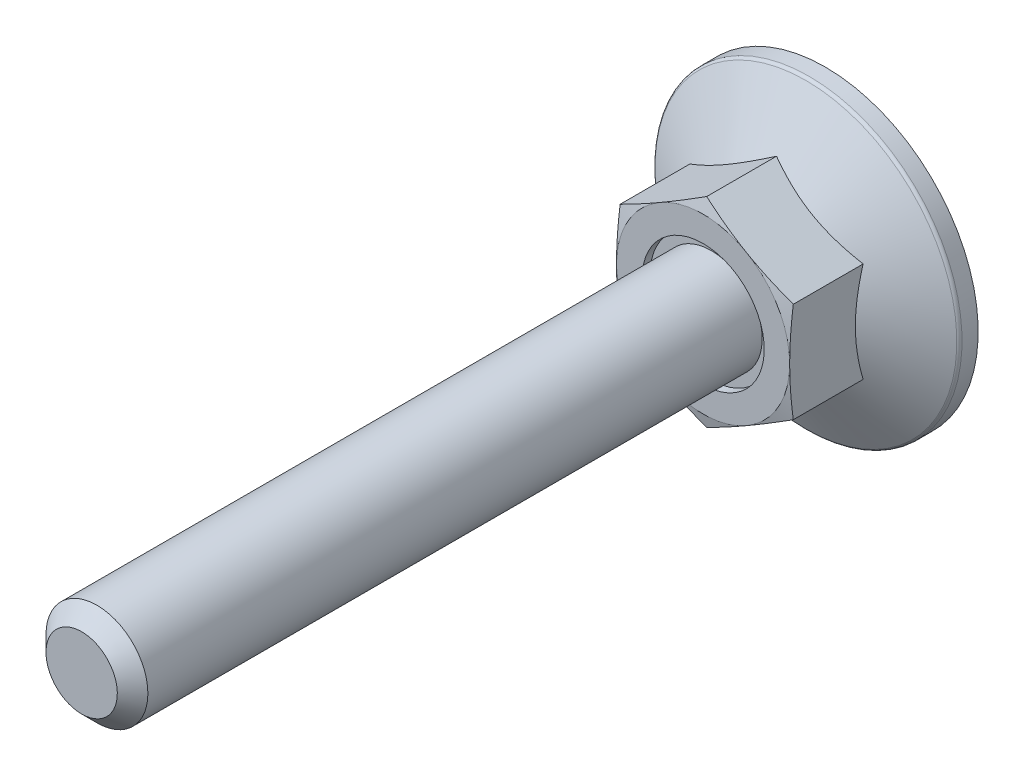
ISO-10303-21;
HEADER;
FILE_DESCRIPTION(('STEP AP214'),'2;1');
FILE_NAME('part.step','',(''),(''),'','','');
FILE_SCHEMA(('AUTOMOTIVE_DESIGN { 1 0 10303 214 1 1 1 1 }'));
ENDSEC;
DATA;
#1=APPLICATION_CONTEXT('core data for automotive mechanical design processes');
#2=APPLICATION_PROTOCOL_DEFINITION('international standard','automotive_design',2000,#1);
#3=PRODUCT_CONTEXT('',#1,'mechanical');
#4=PRODUCT('Part','Part','',(#3));
#5=PRODUCT_RELATED_PRODUCT_CATEGORY('part','',(#4));
#6=PRODUCT_DEFINITION_FORMATION('','',#4);
#7=PRODUCT_DEFINITION_CONTEXT('part definition',#1,'design');
#8=PRODUCT_DEFINITION('design','',#6,#7);
#9=PRODUCT_DEFINITION_SHAPE('','',#8);
#10=(LENGTH_UNIT() NAMED_UNIT(*) SI_UNIT(.MILLI.,.METRE.));
#11=(NAMED_UNIT(*) PLANE_ANGLE_UNIT() SI_UNIT($,.RADIAN.));
#12=(NAMED_UNIT(*) SI_UNIT($,.STERADIAN.) SOLID_ANGLE_UNIT());
#13=UNCERTAINTY_MEASURE_WITH_UNIT(LENGTH_MEASURE(1.E-05),#10,'distance_accuracy_value','');
#14=(GEOMETRIC_REPRESENTATION_CONTEXT(3) GLOBAL_UNCERTAINTY_ASSIGNED_CONTEXT((#13)) GLOBAL_UNIT_ASSIGNED_CONTEXT((#10,
#11,#12)) REPRESENTATION_CONTEXT('',''));
#15=CARTESIAN_POINT('',(0.,0.,0.));
#16=DIRECTION('',(0.,0.,1.));
#17=DIRECTION('',(1.,0.,0.));
#18=AXIS2_PLACEMENT_3D('',#15,#16,#17);
#19=CARTESIAN_POINT('',(0.,0.,11.2));
#20=DIRECTION('',(0.,0.,-1.));
#21=DIRECTION('',(0.,1.,0.));
#22=AXIS2_PLACEMENT_3D('',#19,#20,#21);
#23=PLANE('',#22);
#24=CARTESIAN_POINT('',(0.,0.,11.2));
#25=DIRECTION('',(0.,0.,-1.));
#26=DIRECTION('',(0.,1.,0.));
#27=AXIS2_PLACEMENT_3D('',#24,#25,#26);
#28=CIRCLE('',#27,6.);
#29=CARTESIAN_POINT('',(0.,6.,11.2));
#30=VERTEX_POINT('',#29);
#31=EDGE_CURVE('E108',#30,#30,#28,.T.);
#32=ORIENTED_EDGE('',*,*,#31,.F.);
#33=EDGE_LOOP('',(#32));
#34=FACE_BOUND('',#33,.T.);
#35=CARTESIAN_POINT('',(0.,0.,11.2));
#36=DIRECTION('',(0.,0.,-1.));
#37=DIRECTION('',(0.,1.,0.));
#38=AXIS2_PLACEMENT_3D('',#35,#36,#37);
#39=CIRCLE('',#38,5.);
#40=CARTESIAN_POINT('',(0.,5.,11.2));
#41=VERTEX_POINT('',#40);
#42=EDGE_CURVE('E259',#41,#41,#39,.F.);
#43=ORIENTED_EDGE('',*,*,#42,.F.);
#44=EDGE_LOOP('',(#43));
#45=FACE_BOUND('',#44,.T.);
#46=ADVANCED_FACE('F14',(#34,#45),#23,.F.);
#47=CARTESIAN_POINT('',(0.,9.81495457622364,32.));
#48=DIRECTION('',(0.5,-0.866025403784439,0.));
#49=DIRECTION('',(0.866025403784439,0.5,0.));
#50=AXIS2_PLACEMENT_3D('',#47,#48,#49);
#51=PLANE('',#50);
#52=CARTESIAN_POINT('',(-8.5002,4.90736181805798,4.7935207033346));
#53=CARTESIAN_POINT('',(-8.31336077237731,5.01523349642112,4.85579061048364));
#54=CARTESIAN_POINT('',(-8.1258249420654,5.1235073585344,4.91523445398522));
#55=CARTESIAN_POINT('',(-7.74923024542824,5.34093440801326,5.02769163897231));
#56=CARTESIAN_POINT('',(-7.56017075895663,5.45008795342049,5.08070220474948));
#57=CARTESIAN_POINT('',(-6.9899652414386,5.77929626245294,5.22904336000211));
#58=CARTESIAN_POINT('',(-6.60656835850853,6.00065055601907,5.31341782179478));
#59=CARTESIAN_POINT('',(-6.03282233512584,6.33190297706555,5.41235673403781));
#60=CARTESIAN_POINT('',(-5.84418723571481,6.44081150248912,5.44054155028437));
#61=CARTESIAN_POINT('',(-5.46606397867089,6.65912106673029,5.48780266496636));
#62=CARTESIAN_POINT('',(-5.27657589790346,6.76852206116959,5.5068797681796));
#63=CARTESIAN_POINT('',(-4.8972734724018,6.98751241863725,5.53544197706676));
#64=CARTESIAN_POINT('',(-4.70745974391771,7.09710142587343,5.54493796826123));
#65=CARTESIAN_POINT('',(-4.32765694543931,7.3163806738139,5.55413437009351));
#66=CARTESIAN_POINT('',(-4.13766788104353,7.42607091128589,5.55383508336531));
#67=CARTESIAN_POINT('',(-3.78247698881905,7.63114046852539,5.54412227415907));
#68=CARTESIAN_POINT('',(-3.6172500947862,7.72653426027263,5.53589358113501));
#69=CARTESIAN_POINT('',(-3.28718328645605,7.9170984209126,5.51218750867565));
#70=CARTESIAN_POINT('',(-3.12234339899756,8.01226877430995,5.49670964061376));
#71=CARTESIAN_POINT('',(-2.62846189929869,8.29741139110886,5.43976812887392));
#72=CARTESIAN_POINT('',(-2.30029449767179,8.48687892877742,5.38780368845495));
#73=CARTESIAN_POINT('',(-1.64047857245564,8.86782383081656,5.25789180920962));
#74=CARTESIAN_POINT('',(-1.30891425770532,9.05925257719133,5.17939367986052));
#75=CARTESIAN_POINT('',(-0.650730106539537,9.43925537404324,5.00123540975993));
#76=CARTESIAN_POINT('',(-0.32410184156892,9.62783429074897,4.90161711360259));
#77=CARTESIAN_POINT('',(0.000200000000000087,9.81507004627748,4.7935207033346));
#78=B_SPLINE_CURVE_WITH_KNOTS('',3,(#52,#53,#54,#55,#56,#57,#58,#59,#60,#61,#62,#63,#64,#65,#66,
#67,#68,#69,#70,#71,#72,#73,#74,#75,#76,#77),.UNSPECIFIED.,.F.,.F.,(4,2,2,2,2,2,2,2,2,2,2,2,4),
(0.,0.673596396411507,1.34748239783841,2.69805431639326,3.356799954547,4.01548737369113,
4.67342558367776,5.33134346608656,5.90409556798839,6.47688628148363,7.62328361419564,
8.79510569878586,9.9646274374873),.UNSPECIFIED.);
#79=CARTESIAN_POINT('',(-8.5,4.90747728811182,4.79358737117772));
#80=VERTEX_POINT('',#79);
#81=CARTESIAN_POINT('',(0.,9.81495457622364,4.79358737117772));
#82=VERTEX_POINT('',#81);
#83=EDGE_CURVE('E97',#80,#82,#78,.T.);
#84=ORIENTED_EDGE('',*,*,#83,.F.);
#85=DIRECTION('',(0.,0.,-1.));
#86=VECTOR('',#85,1.);
#87=CARTESIAN_POINT('',(-8.5,4.90747728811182,32.));
#88=LINE('',#87,#86);
#89=CARTESIAN_POINT('',(-8.5,4.90747728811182,11.6476589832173));
#90=VERTEX_POINT('',#89);
#91=EDGE_CURVE('E86',#90,#80,#88,.T.);
#92=ORIENTED_EDGE('',*,*,#91,.F.);
#93=CARTESIAN_POINT('',(0.000200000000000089,9.81507004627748,11.6476280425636));
#94=CARTESIAN_POINT('',(-0.352800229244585,9.61126526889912,11.7022599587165));
#95=CARTESIAN_POINT('',(-0.706440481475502,9.40709097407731,11.7518566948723));
#96=CARTESIAN_POINT('',(-1.41496987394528,8.99802133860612,11.8389934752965));
#97=CARTESIAN_POINT('',(-1.76985946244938,8.79312573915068,11.8765286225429));
#98=CARTESIAN_POINT('',(-2.47873586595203,8.38385575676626,11.9373509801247));
#99=CARTESIAN_POINT('',(-2.83271788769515,8.17948414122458,11.9607107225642));
#100=CARTESIAN_POINT('',(-3.5411333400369,7.77048028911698,11.9920337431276));
#101=CARTESIAN_POINT('',(-3.89556667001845,7.56584811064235,12.));
#102=CARTESIAN_POINT('',(-4.60443332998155,7.15658375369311,12.));
#103=CARTESIAN_POINT('',(-4.9588666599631,6.95195157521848,11.9920337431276));
#104=CARTESIAN_POINT('',(-5.66728211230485,6.54294772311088,11.9607107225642));
#105=CARTESIAN_POINT('',(-6.02126413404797,6.33857610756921,11.9373509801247));
#106=CARTESIAN_POINT('',(-6.73014053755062,5.92930612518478,11.8765286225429));
#107=CARTESIAN_POINT('',(-7.08503012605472,5.72441052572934,11.8389934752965));
#108=CARTESIAN_POINT('',(-7.7935595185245,5.31534089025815,11.7518566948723));
#109=CARTESIAN_POINT('',(-8.14719977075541,5.11116659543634,11.7022599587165));
#110=CARTESIAN_POINT('',(-8.5002,4.90736181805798,11.6476280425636));
#111=B_SPLINE_CURVE_WITH_KNOTS('',3,(#93,#94,#95,#96,#97,#98,#99,#100,#101,#102,#103,#104,#105,
#106,#107,#108,#109,#110),.UNSPECIFIED.,.F.,.F.,(4,2,2,2,2,2,2,2,4),(0.,1.23382789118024,
2.46815608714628,3.69611406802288,4.92383440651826,6.15155474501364,7.37951272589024,
8.61384092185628,9.84766881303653),.UNSPECIFIED.);
#112=CARTESIAN_POINT('',(-4.25,7.36121593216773,12.));
#113=VERTEX_POINT('',#112);
#114=EDGE_CURVE('E186',#113,#90,#111,.T.);
#115=ORIENTED_EDGE('',*,*,#114,.F.);
#116=CARTESIAN_POINT('',(0.,9.81495457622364,11.6476589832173));
#117=VERTEX_POINT('',#116);
#118=EDGE_CURVE('E318',#117,#113,#111,.T.);
#119=ORIENTED_EDGE('',*,*,#118,.F.);
#120=DIRECTION('',(0.,0.,-1.));
#121=VECTOR('',#120,1.);
#122=CARTESIAN_POINT('',(0.,9.81495457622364,32.));
#123=LINE('',#122,#121);
#124=EDGE_CURVE('E101',#117,#82,#123,.T.);
#125=ORIENTED_EDGE('',*,*,#124,.T.);
#126=EDGE_LOOP('',(#84,#92,#115,#119,#125));
#127=FACE_BOUND('',#126,.T.);
#128=ADVANCED_FACE('F100',(#127),#51,.F.);
#129=CARTESIAN_POINT('',(8.5,4.90747728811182,32.));
#130=DIRECTION('',(-0.5,-0.866025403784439,0.));
#131=DIRECTION('',(0.866025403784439,-0.5,0.));
#132=AXIS2_PLACEMENT_3D('',#129,#130,#131);
#133=PLANE('',#132);
#134=CARTESIAN_POINT('',(-0.0002,9.81507004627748,4.7935207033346));
#135=CARTESIAN_POINT('',(0.186639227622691,9.70719836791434,4.85579061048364));
#136=CARTESIAN_POINT('',(0.374175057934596,9.59892450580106,4.91523445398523));
#137=CARTESIAN_POINT('',(0.750769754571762,9.3814974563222,5.02769163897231));
#138=CARTESIAN_POINT('',(0.939829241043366,9.27234391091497,5.08070220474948));
#139=CARTESIAN_POINT('',(1.5100347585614,8.94313560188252,5.22904336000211));
#140=CARTESIAN_POINT('',(1.89343164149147,8.72178130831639,5.31341782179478));
#141=CARTESIAN_POINT('',(2.46717766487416,8.39052888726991,5.41235673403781));
#142=CARTESIAN_POINT('',(2.65581276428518,8.28162036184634,5.44054155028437));
#143=CARTESIAN_POINT('',(3.03393602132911,8.06331079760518,5.48780266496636));
#144=CARTESIAN_POINT('',(3.22342410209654,7.95390980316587,5.5068797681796));
#145=CARTESIAN_POINT('',(3.6027265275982,7.73491944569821,5.53544197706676));
#146=CARTESIAN_POINT('',(3.79254025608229,7.62533043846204,5.54493796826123));
#147=CARTESIAN_POINT('',(4.17234305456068,7.40605119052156,5.55413437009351));
#148=CARTESIAN_POINT('',(4.36233211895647,7.29636095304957,5.55383508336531));
#149=CARTESIAN_POINT('',(4.71752301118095,7.09129139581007,5.54412227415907));
#150=CARTESIAN_POINT('',(4.8827499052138,6.99589760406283,5.53589358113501));
#151=CARTESIAN_POINT('',(5.21281671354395,6.80533344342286,5.51218750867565));
#152=CARTESIAN_POINT('',(5.37765660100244,6.71016309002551,5.49670964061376));
#153=CARTESIAN_POINT('',(5.87153810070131,6.42502047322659,5.43976812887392));
#154=CARTESIAN_POINT('',(6.19970550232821,6.23555293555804,5.38780368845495));
#155=CARTESIAN_POINT('',(6.85952142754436,5.8546080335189,5.25789180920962));
#156=CARTESIAN_POINT('',(7.19108574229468,5.66317928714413,5.17939367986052));
#157=CARTESIAN_POINT('',(7.84926989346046,5.28317649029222,5.00123540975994));
#158=CARTESIAN_POINT('',(8.17589815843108,5.09459757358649,4.90161711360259));
#159=CARTESIAN_POINT('',(8.5002,4.90736181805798,4.7935207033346));
#160=B_SPLINE_CURVE_WITH_KNOTS('',3,(#134,#135,#136,#137,#138,#139,#140,#141,#142,#143,#144,
#145,#146,#147,#148,#149,#150,#151,#152,#153,#154,#155,#156,#157,#158,#159),.UNSPECIFIED.,.F.,
.F.,(4,2,2,2,2,2,2,2,2,2,2,2,4),(0.,0.673596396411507,1.34748239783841,2.69805431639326,
3.356799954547,4.01548737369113,4.67342558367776,5.33134346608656,5.90409556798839,
6.47688628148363,7.62328361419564,8.79510569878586,9.9646274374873),.UNSPECIFIED.);
#161=CARTESIAN_POINT('',(8.5,4.90747728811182,4.79358737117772));
#162=VERTEX_POINT('',#161);
#163=EDGE_CURVE('E29',#82,#162,#160,.T.);
#164=ORIENTED_EDGE('',*,*,#163,.F.);
#165=ORIENTED_EDGE('',*,*,#124,.F.);
#166=CARTESIAN_POINT('',(8.5002,4.90736181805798,11.6476280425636));
#167=CARTESIAN_POINT('',(8.14719977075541,5.11116659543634,11.7022599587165));
#168=CARTESIAN_POINT('',(7.7935595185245,5.31534089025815,11.7518566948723));
#169=CARTESIAN_POINT('',(7.08503012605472,5.72441052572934,11.8389934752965));
#170=CARTESIAN_POINT('',(6.73014053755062,5.92930612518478,11.8765286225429));
#171=CARTESIAN_POINT('',(6.02126413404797,6.33857610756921,11.9373509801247));
#172=CARTESIAN_POINT('',(5.66728211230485,6.54294772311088,11.9607107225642));
#173=CARTESIAN_POINT('',(4.9588666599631,6.95195157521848,11.9920337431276));
#174=CARTESIAN_POINT('',(4.60443332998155,7.15658375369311,12.));
#175=CARTESIAN_POINT('',(3.89556667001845,7.56584811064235,12.));
#176=CARTESIAN_POINT('',(3.5411333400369,7.77048028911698,11.9920337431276));
#177=CARTESIAN_POINT('',(2.83271788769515,8.17948414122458,11.9607107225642));
#178=CARTESIAN_POINT('',(2.47873586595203,8.38385575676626,11.9373509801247));
#179=CARTESIAN_POINT('',(1.76985946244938,8.79312573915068,11.8765286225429));
#180=CARTESIAN_POINT('',(1.41496987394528,8.99802133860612,11.8389934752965));
#181=CARTESIAN_POINT('',(0.706440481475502,9.40709097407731,11.7518566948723));
#182=CARTESIAN_POINT('',(0.352800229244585,9.61126526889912,11.7022599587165));
#183=CARTESIAN_POINT('',(-0.000200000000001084,9.81507004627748,11.6476280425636));
#184=B_SPLINE_CURVE_WITH_KNOTS('',3,(#166,#167,#168,#169,#170,#171,#172,#173,#174,#175,#176,
#177,#178,#179,#180,#181,#182,#183),.UNSPECIFIED.,.F.,.F.,(4,2,2,2,2,2,2,2,4),(0.,
1.23382789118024,2.46815608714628,3.69611406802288,4.92383440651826,6.15155474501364,
7.37951272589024,8.61384092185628,9.84766881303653),.UNSPECIFIED.);
#185=CARTESIAN_POINT('',(4.25,7.36121593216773,12.));
#186=VERTEX_POINT('',#185);
#187=EDGE_CURVE('E177',#186,#117,#184,.T.);
#188=ORIENTED_EDGE('',*,*,#187,.F.);
#189=CARTESIAN_POINT('',(8.5,4.90747728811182,11.6476589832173));
#190=VERTEX_POINT('',#189);
#191=EDGE_CURVE('E184',#190,#186,#184,.T.);
#192=ORIENTED_EDGE('',*,*,#191,.F.);
#193=DIRECTION('',(0.,0.,-1.));
#194=VECTOR('',#193,1.);
#195=CARTESIAN_POINT('',(8.5,4.90747728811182,32.));
#196=LINE('',#195,#194);
#197=EDGE_CURVE('E216',#190,#162,#196,.T.);
#198=ORIENTED_EDGE('',*,*,#197,.T.);
#199=EDGE_LOOP('',(#164,#165,#188,#192,#198));
#200=FACE_BOUND('',#199,.T.);
#201=ADVANCED_FACE('F192',(#200),#133,.F.);
#202=CARTESIAN_POINT('',(8.5,-4.90747728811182,32.));
#203=DIRECTION('',(-1.,0.,0.));
#204=DIRECTION('',(0.,-1.,0.));
#205=AXIS2_PLACEMENT_3D('',#202,#203,#204);
#206=PLANE('',#205);
#207=CARTESIAN_POINT('',(8.5,13.0314294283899,1.47752704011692));
#208=CARTESIAN_POINT('',(8.5,12.6612665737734,1.65647774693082));
#209=CARTESIAN_POINT('',(8.5,12.290237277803,1.83366776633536));
#210=CARTESIAN_POINT('',(8.5,11.5459841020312,2.1835324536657));
#211=CARTESIAN_POINT('',(8.5,11.1727598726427,2.3562063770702));
#212=CARTESIAN_POINT('',(8.5,10.4216603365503,2.69694543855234));
#213=CARTESIAN_POINT('',(8.5,10.0437706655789,2.86497902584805));
#214=CARTESIAN_POINT('',(8.5,9.2849306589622,3.19396010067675));
#215=CARTESIAN_POINT('',(8.5,8.90398047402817,3.35490793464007));
#216=CARTESIAN_POINT('',(8.5,8.12702308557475,3.67249615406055));
#217=CARTESIAN_POINT('',(8.5,7.73090483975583,3.82886642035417));
#218=CARTESIAN_POINT('',(8.5,6.93398073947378,4.12940330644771));
#219=CARTESIAN_POINT('',(8.5,6.53317435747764,4.27356853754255));
#220=CARTESIAN_POINT('',(8.5,5.72703031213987,4.54580160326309));
#221=CARTESIAN_POINT('',(8.5,5.32170421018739,4.67390329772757));
#222=CARTESIAN_POINT('',(8.5,4.50525785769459,4.90980359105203));
#223=CARTESIAN_POINT('',(8.5,4.09413952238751,5.01760873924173));
#224=CARTESIAN_POINT('',(8.5,3.26789885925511,5.20711197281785));
#225=CARTESIAN_POINT('',(8.5,2.85280627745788,5.28893618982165));
#226=CARTESIAN_POINT('',(8.5,2.22651264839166,5.38853539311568));
#227=CARTESIAN_POINT('',(8.5,2.01712321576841,5.41788026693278));
#228=CARTESIAN_POINT('',(8.5,1.59735566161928,5.46827917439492));
#229=CARTESIAN_POINT('',(8.5,1.38697763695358,5.48933400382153));
#230=CARTESIAN_POINT('',(8.5,0.968196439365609,5.52247691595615));
#231=CARTESIAN_POINT('',(8.5,0.759802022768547,5.53467524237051));
#232=CARTESIAN_POINT('',(8.5,0.342684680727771,5.55026003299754));
#233=CARTESIAN_POINT('',(8.5,0.133961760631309,5.5536466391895));
#234=CARTESIAN_POINT('',(8.5,-0.283445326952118,5.55152742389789));
#235=CARTESIAN_POINT('',(8.5,-0.492129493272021,5.546021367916));
#236=CARTESIAN_POINT('',(8.5,-0.909085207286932,5.52624824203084));
#237=CARTESIAN_POINT('',(8.5,-1.11735673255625,5.51198070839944));
#238=CARTESIAN_POINT('',(8.5,-1.62231800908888,5.46706351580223));
#239=CARTESIAN_POINT('',(8.5,-1.91862399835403,5.43201243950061));
#240=CARTESIAN_POINT('',(8.5,-2.50892471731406,5.34612267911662));
#241=CARTESIAN_POINT('',(8.5,-2.80291910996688,5.29528173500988));
#242=CARTESIAN_POINT('',(8.5,-3.68114216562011,5.12178025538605));
#243=CARTESIAN_POINT('',(8.5,-4.26128126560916,4.97817413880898));
#244=CARTESIAN_POINT('',(8.5,-5.12903133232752,4.73045572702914));
#245=CARTESIAN_POINT('',(8.5,-5.42116721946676,4.64129591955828));
#246=CARTESIAN_POINT('',(8.5,-6.0025970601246,4.45406394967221));
#247=CARTESIAN_POINT('',(8.5,-6.29189099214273,4.35599171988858));
#248=CARTESIAN_POINT('',(8.5,-6.86774141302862,4.15248019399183));
#249=CARTESIAN_POINT('',(8.5,-7.15429879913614,4.0470434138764));
#250=CARTESIAN_POINT('',(8.5,-7.72505625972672,3.83000899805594));
#251=CARTESIAN_POINT('',(8.5,-8.00925638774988,3.71841150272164));
#252=CARTESIAN_POINT('',(8.5,-8.7865968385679,3.40502511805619));
#253=CARTESIAN_POINT('',(8.5,-9.2776226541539,3.197996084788));
#254=CARTESIAN_POINT('',(8.5,-10.2546964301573,2.77246752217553));
#255=CARTESIAN_POINT('',(8.5,-10.7407438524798,2.55396676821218));
#256=CARTESIAN_POINT('',(8.5,-11.7090438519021,2.108282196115));
#257=CARTESIAN_POINT('',(8.5,-12.1912949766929,1.88109523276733));
#258=CARTESIAN_POINT('',(8.5,-13.1526185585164,1.42016244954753));
#259=CARTESIAN_POINT('',(8.5,-13.6316911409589,1.18641689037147));
#260=CARTESIAN_POINT('',(8.5,-14.588034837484,0.713462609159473));
#261=CARTESIAN_POINT('',(8.5,-15.0653020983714,0.47424611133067));
#262=CARTESIAN_POINT('',(8.5,-16.0177905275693,-0.00822936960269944));
#263=CARTESIAN_POINT('',(8.5,-16.4930116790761,-0.251488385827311));
#264=CARTESIAN_POINT('',(8.5,-17.4416812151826,-0.741191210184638));
#265=CARTESIAN_POINT('',(8.5,-17.9151299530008,-0.987634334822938));
#266=CARTESIAN_POINT('',(8.5,-18.8606492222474,-1.48315179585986));
#267=CARTESIAN_POINT('',(8.5,-19.3327197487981,-1.73222614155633));
#268=CARTESIAN_POINT('',(8.5,-20.6461392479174,-2.42904815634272));
#269=CARTESIAN_POINT('',(8.5,-21.4862394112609,-2.87914918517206));
#270=CARTESIAN_POINT('',(8.5,-23.1638169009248,-3.78432075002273));
#271=CARTESIAN_POINT('',(8.5,-24.0012940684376,-4.23939157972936));
#272=CARTESIAN_POINT('',(8.5,-25.671623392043,-5.15180725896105));
#273=CARTESIAN_POINT('',(8.5,-26.5044818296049,-5.60914061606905));
#274=CARTESIAN_POINT('',(8.5,-27.7525740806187,-6.29723391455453));
#275=CARTESIAN_POINT('',(8.5,-28.1683903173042,-6.52693873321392));
#276=CARTESIAN_POINT('',(8.5,-28.9996764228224,-6.98697325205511));
#277=CARTESIAN_POINT('',(8.5,-29.4151462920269,-7.21730295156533));
#278=CARTESIAN_POINT('',(8.5,-29.8304643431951,-7.44790614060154));
#279=B_SPLINE_CURVE_WITH_KNOTS('',3,(#207,#208,#209,#210,#211,#212,#213,#214,#215,#216,#217,
#218,#219,#220,#221,#222,#223,#224,#225,#226,#227,#228,#229,#230,#231,#232,#233,#234,#235,#236,
#237,#238,#239,#240,#241,#242,#243,#244,#245,#246,#247,#248,#249,#250,#251,#252,#253,#254,#255,
#256,#257,#258,#259,#260,#261,#262,#263,#264,#265,#266,#267,#268,#269,#270,#271,#272,#273,#274,
#275,#276,#277,#278),.UNSPECIFIED.,.F.,.F.,(4,2,2,2,2,2,2,2,2,2,2,2,2,2,2,2,2,2,2,2,2,2,2,2,2,2,
2,2,2,2,2,2,2,2,2,4),(0.,1.23346428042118,2.46713064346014,3.70776702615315,4.94834268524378,
6.22578289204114,7.5033682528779,8.77821366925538,10.0526470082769,11.32079515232,
11.9549638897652,12.5890717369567,13.2151443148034,13.8412068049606,14.4672858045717,
15.0933979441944,15.9880059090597,16.8827419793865,18.6732029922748,19.5894472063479,
20.5056983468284,21.4216379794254,22.3375567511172,23.9359919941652,25.5345982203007,
27.1337888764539,28.7329160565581,30.3344778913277,31.9360528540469,33.5372895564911,
35.1385319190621,37.9977422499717,40.8571224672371,43.7075995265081,45.1327331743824,
46.5578652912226),.UNSPECIFIED.);
#280=CARTESIAN_POINT('',(8.5,-4.90747728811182,4.79358737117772));
#281=VERTEX_POINT('',#280);
#282=EDGE_CURVE('E37',#162,#281,#279,.T.);
#283=ORIENTED_EDGE('',*,*,#282,.F.);
#284=ORIENTED_EDGE('',*,*,#197,.F.);
#285=CARTESIAN_POINT('',(8.5,12.9820891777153,10.1197370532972));
#286=CARTESIAN_POINT('',(8.5,12.5964686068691,10.2061594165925));
#287=CARTESIAN_POINT('',(8.5,12.2106068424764,10.2915248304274));
#288=CARTESIAN_POINT('',(8.5,11.4382824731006,10.4595712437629));
#289=CARTESIAN_POINT('',(8.5,11.0518198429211,10.5422521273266));
#290=CARTESIAN_POINT('',(8.5,10.2778290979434,10.7044309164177));
#291=CARTESIAN_POINT('',(8.5,9.89030030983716,10.7839256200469));
#292=CARTESIAN_POINT('',(8.5,9.11443612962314,10.9388739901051));
#293=CARTESIAN_POINT('',(8.5,8.72610074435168,11.0143276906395));
#294=CARTESIAN_POINT('',(8.5,7.95158013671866,11.159650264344));
#295=CARTESIAN_POINT('',(8.5,7.56540239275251,11.2295587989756));
#296=CARTESIAN_POINT('',(8.5,6.79199352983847,11.3632725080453));
#297=CARTESIAN_POINT('',(8.5,6.40476243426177,11.4270778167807));
#298=CARTESIAN_POINT('',(8.5,5.62917169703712,11.54714843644));
#299=CARTESIAN_POINT('',(8.5,5.24081220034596,11.6034146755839));
#300=CARTESIAN_POINT('',(8.5,4.46285737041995,11.70674908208));
#301=CARTESIAN_POINT('',(8.5,4.07326203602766,11.7538172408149));
#302=CARTESIAN_POINT('',(8.5,3.28844017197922,11.8374226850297));
#303=CARTESIAN_POINT('',(8.5,2.89320002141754,11.8738340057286));
#304=CARTESIAN_POINT('',(8.5,2.10172608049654,11.9336139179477));
#305=CARTESIAN_POINT('',(8.5,1.70549231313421,11.9569828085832));
#306=CARTESIAN_POINT('',(8.5,0.91260591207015,11.9893148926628));
#307=CARTESIAN_POINT('',(8.5,0.515953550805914,11.9982846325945));
#308=CARTESIAN_POINT('',(8.5,-0.277408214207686,12.0012669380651));
#309=CARTESIAN_POINT('',(8.5,-0.674117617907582,11.9952795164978));
#310=CARTESIAN_POINT('',(8.5,-1.46847963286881,11.9686842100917));
#311=CARTESIAN_POINT('',(8.5,-1.86613043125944,11.9480232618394));
#312=CARTESIAN_POINT('',(8.5,-2.66049684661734,11.8932602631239));
#313=CARTESIAN_POINT('',(8.5,-3.05721244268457,11.8591579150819));
#314=CARTESIAN_POINT('',(8.5,-3.84970511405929,11.7792347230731));
#315=CARTESIAN_POINT('',(8.5,-4.24548140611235,11.7334062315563));
#316=CARTESIAN_POINT('',(8.5,-5.03576028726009,11.6319377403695));
#317=CARTESIAN_POINT('',(8.5,-5.43026287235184,11.5762977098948));
#318=CARTESIAN_POINT('',(8.5,-6.19195385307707,11.4609360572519));
#319=CARTESIAN_POINT('',(8.5,-6.55922094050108,11.4017287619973));
#320=CARTESIAN_POINT('',(8.5,-7.29278719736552,11.2775674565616));
#321=CARTESIAN_POINT('',(8.5,-7.65908634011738,11.2126132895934));
#322=CARTESIAN_POINT('',(8.5,-8.39085027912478,11.078008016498));
#323=CARTESIAN_POINT('',(8.5,-8.75631499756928,11.0083564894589));
#324=CARTESIAN_POINT('',(8.5,-9.48649515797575,10.8652200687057));
#325=CARTESIAN_POINT('',(8.5,-9.85121059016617,10.7917351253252));
#326=CARTESIAN_POINT('',(8.5,-10.5800753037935,10.6416087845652));
#327=CARTESIAN_POINT('',(8.5,-10.944224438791,10.5649666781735));
#328=CARTESIAN_POINT('',(8.5,-11.6719684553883,10.4090909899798));
#329=CARTESIAN_POINT('',(8.5,-12.0355633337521,10.3298573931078));
#330=CARTESIAN_POINT('',(8.5,-13.1255915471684,10.0889686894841));
#331=CARTESIAN_POINT('',(8.5,-13.8513178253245,9.92411536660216));
#332=CARTESIAN_POINT('',(8.5,-15.2942598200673,9.59010912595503));
#333=CARTESIAN_POINT('',(8.5,-16.0114890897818,9.42101437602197));
#334=CARTESIAN_POINT('',(8.5,-17.4449475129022,9.07858755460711));
#335=CARTESIAN_POINT('',(8.5,-18.1611766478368,8.90525540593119));
#336=CARTESIAN_POINT('',(8.5,-19.5919856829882,8.5556799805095));
#337=CARTESIAN_POINT('',(8.5,-20.306566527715,8.37944056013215));
#338=CARTESIAN_POINT('',(8.5,-21.7351057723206,8.02455520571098));
#339=CARTESIAN_POINT('',(8.5,-22.4490641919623,7.8459093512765));
#340=CARTESIAN_POINT('',(8.5,-23.1628057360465,7.66641079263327));
#341=B_SPLINE_CURVE_WITH_KNOTS('',3,(#285,#286,#287,#288,#289,#290,#291,#292,#293,#294,#295,
#296,#297,#298,#299,#300,#301,#302,#303,#304,#305,#306,#307,#308,#309,#310,#311,#312,#313,#314,
#315,#316,#317,#318,#319,#320,#321,#322,#323,#324,#325,#326,#327,#328,#329,#330,#331,#332,#333,
#334,#335,#336,#337,#338,#339,#340),.UNSPECIFIED.,.F.,.F.,(4,2,2,2,2,2,2,2,2,2,2,2,2,2,2,2,2,2,
2,2,2,2,2,2,2,2,2,4),(0.,1.18556310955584,2.37117735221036,3.55795462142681,4.74472187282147,
5.92204594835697,7.09934411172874,8.27649719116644,9.45365137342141,10.6442044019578,
11.8347301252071,13.0247144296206,14.2146977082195,15.4090063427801,16.6033414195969,
17.7984574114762,18.9935771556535,20.1095500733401,21.2255534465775,22.3416569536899,
23.4577749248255,24.5741449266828,25.6905214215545,27.9231231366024,30.1337863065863,
32.3444897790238,34.5524651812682,36.7603677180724),.UNSPECIFIED.);
#342=CARTESIAN_POINT('',(8.5,0.,12.));
#343=VERTEX_POINT('',#342);
#344=EDGE_CURVE('E170',#343,#190,#341,.F.);
#345=ORIENTED_EDGE('',*,*,#344,.F.);
#346=CARTESIAN_POINT('',(8.5,-4.90747728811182,11.6476589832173));
#347=VERTEX_POINT('',#346);
#348=EDGE_CURVE('E185',#347,#343,#341,.F.);
#349=ORIENTED_EDGE('',*,*,#348,.F.);
#350=DIRECTION('',(0.,0.,-1.));
#351=VECTOR('',#350,1.);
#352=CARTESIAN_POINT('',(8.5,-4.90747728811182,32.));
#353=LINE('',#352,#351);
#354=EDGE_CURVE('E218',#347,#281,#353,.T.);
#355=ORIENTED_EDGE('',*,*,#354,.T.);
#356=EDGE_LOOP('',(#283,#284,#345,#349,#355));
#357=FACE_BOUND('',#356,.T.);
#358=ADVANCED_FACE('F195',(#357),#206,.F.);
#359=CARTESIAN_POINT('',(0.,-9.81495457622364,32.));
#360=DIRECTION('',(-0.5,0.866025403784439,0.));
#361=DIRECTION('',(-0.866025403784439,-0.5,0.));
#362=AXIS2_PLACEMENT_3D('',#359,#360,#361);
#363=PLANE('',#362);
#364=CARTESIAN_POINT('',(8.5002,-4.90736181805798,4.7935207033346));
#365=CARTESIAN_POINT('',(8.31336077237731,-5.01523349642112,4.85579061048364));
#366=CARTESIAN_POINT('',(8.1258249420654,-5.1235073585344,4.91523445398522));
#367=CARTESIAN_POINT('',(7.74923024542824,-5.34093440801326,5.02769163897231));
#368=CARTESIAN_POINT('',(7.56017075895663,-5.45008795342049,5.08070220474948));
#369=CARTESIAN_POINT('',(6.9899652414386,-5.77929626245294,5.22904336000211));
#370=CARTESIAN_POINT('',(6.60656835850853,-6.00065055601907,5.31341782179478));
#371=CARTESIAN_POINT('',(6.03282233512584,-6.33190297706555,5.41235673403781));
#372=CARTESIAN_POINT('',(5.84418723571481,-6.44081150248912,5.44054155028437));
#373=CARTESIAN_POINT('',(5.46606397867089,-6.65912106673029,5.48780266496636));
#374=CARTESIAN_POINT('',(5.27657589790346,-6.76852206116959,5.5068797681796));
#375=CARTESIAN_POINT('',(4.8972734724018,-6.98751241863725,5.53544197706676));
#376=CARTESIAN_POINT('',(4.70745974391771,-7.09710142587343,5.54493796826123));
#377=CARTESIAN_POINT('',(4.32765694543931,-7.3163806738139,5.55413437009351));
#378=CARTESIAN_POINT('',(4.13766788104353,-7.42607091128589,5.55383508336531));
#379=CARTESIAN_POINT('',(3.78247698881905,-7.63114046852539,5.54412227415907));
#380=CARTESIAN_POINT('',(3.6172500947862,-7.72653426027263,5.53589358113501));
#381=CARTESIAN_POINT('',(3.28718328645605,-7.9170984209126,5.51218750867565));
#382=CARTESIAN_POINT('',(3.12234339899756,-8.01226877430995,5.49670964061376));
#383=CARTESIAN_POINT('',(2.62846189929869,-8.29741139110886,5.43976812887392));
#384=CARTESIAN_POINT('',(2.30029449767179,-8.48687892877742,5.38780368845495));
#385=CARTESIAN_POINT('',(1.64047857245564,-8.86782383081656,5.25789180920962));
#386=CARTESIAN_POINT('',(1.30891425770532,-9.05925257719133,5.17939367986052));
#387=CARTESIAN_POINT('',(0.650730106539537,-9.43925537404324,5.00123540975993));
#388=CARTESIAN_POINT('',(0.32410184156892,-9.62783429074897,4.90161711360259));
#389=CARTESIAN_POINT('',(-0.000200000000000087,-9.81507004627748,4.7935207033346));
#390=B_SPLINE_CURVE_WITH_KNOTS('',3,(#364,#365,#366,#367,#368,#369,#370,#371,#372,#373,#374,
#375,#376,#377,#378,#379,#380,#381,#382,#383,#384,#385,#386,#387,#388,#389),.UNSPECIFIED.,.F.,
.F.,(4,2,2,2,2,2,2,2,2,2,2,2,4),(0.,0.673596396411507,1.34748239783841,2.69805431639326,
3.356799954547,4.01548737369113,4.67342558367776,5.33134346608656,5.90409556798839,
6.47688628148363,7.62328361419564,8.79510569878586,9.9646274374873),.UNSPECIFIED.);
#391=CARTESIAN_POINT('',(0.,-9.81495457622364,4.79358737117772));
#392=VERTEX_POINT('',#391);
#393=EDGE_CURVE('E276',#281,#392,#390,.T.);
#394=ORIENTED_EDGE('',*,*,#393,.F.);
#395=ORIENTED_EDGE('',*,*,#354,.F.);
#396=CARTESIAN_POINT('',(-0.000200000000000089,-9.81507004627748,11.6476280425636));
#397=CARTESIAN_POINT('',(0.352800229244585,-9.61126526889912,11.7022599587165));
#398=CARTESIAN_POINT('',(0.706440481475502,-9.40709097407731,11.7518566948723));
#399=CARTESIAN_POINT('',(1.41496987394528,-8.99802133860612,11.8389934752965));
#400=CARTESIAN_POINT('',(1.76985946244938,-8.79312573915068,11.8765286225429));
#401=CARTESIAN_POINT('',(2.47873586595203,-8.38385575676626,11.9373509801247));
#402=CARTESIAN_POINT('',(2.83271788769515,-8.17948414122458,11.9607107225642));
#403=CARTESIAN_POINT('',(3.5411333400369,-7.77048028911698,11.9920337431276));
#404=CARTESIAN_POINT('',(3.89556667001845,-7.56584811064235,12.));
#405=CARTESIAN_POINT('',(4.60443332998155,-7.15658375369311,12.));
#406=CARTESIAN_POINT('',(4.9588666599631,-6.95195157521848,11.9920337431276));
#407=CARTESIAN_POINT('',(5.66728211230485,-6.54294772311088,11.9607107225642));
#408=CARTESIAN_POINT('',(6.02126413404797,-6.33857610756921,11.9373509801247));
#409=CARTESIAN_POINT('',(6.73014053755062,-5.92930612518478,11.8765286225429));
#410=CARTESIAN_POINT('',(7.08503012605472,-5.72441052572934,11.8389934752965));
#411=CARTESIAN_POINT('',(7.7935595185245,-5.31534089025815,11.7518566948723));
#412=CARTESIAN_POINT('',(8.14719977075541,-5.11116659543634,11.7022599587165));
#413=CARTESIAN_POINT('',(8.5002,-4.90736181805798,11.6476280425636));
#414=B_SPLINE_CURVE_WITH_KNOTS('',3,(#396,#397,#398,#399,#400,#401,#402,#403,#404,#405,#406,
#407,#408,#409,#410,#411,#412,#413),.UNSPECIFIED.,.F.,.F.,(4,2,2,2,2,2,2,2,4),(0.,
1.23382789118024,2.46815608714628,3.69611406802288,4.92383440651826,6.15155474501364,
7.37951272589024,8.61384092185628,9.84766881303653),.UNSPECIFIED.);
#415=CARTESIAN_POINT('',(4.25,-7.36121593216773,12.));
#416=VERTEX_POINT('',#415);
#417=EDGE_CURVE('E164',#416,#347,#414,.T.);
#418=ORIENTED_EDGE('',*,*,#417,.F.);
#419=CARTESIAN_POINT('',(0.,-9.81495457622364,11.6476589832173));
#420=VERTEX_POINT('',#419);
#421=EDGE_CURVE('E299',#420,#416,#414,.T.);
#422=ORIENTED_EDGE('',*,*,#421,.F.);
#423=DIRECTION('',(0.,0.,-1.));
#424=VECTOR('',#423,1.);
#425=CARTESIAN_POINT('',(0.,-9.81495457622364,32.));
#426=LINE('',#425,#424);
#427=EDGE_CURVE('E220',#420,#392,#426,.T.);
#428=ORIENTED_EDGE('',*,*,#427,.T.);
#429=EDGE_LOOP('',(#394,#395,#418,#422,#428));
#430=FACE_BOUND('',#429,.T.);
#431=ADVANCED_FACE('F281',(#430),#363,.F.);
#432=CARTESIAN_POINT('',(-8.5,-4.90747728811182,32.));
#433=DIRECTION('',(0.5,0.866025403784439,0.));
#434=DIRECTION('',(-0.866025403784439,0.5,0.));
#435=AXIS2_PLACEMENT_3D('',#432,#433,#434);
#436=PLANE('',#435);
#437=CARTESIAN_POINT('',(0.0002,-9.81507004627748,4.7935207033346));
#438=CARTESIAN_POINT('',(-0.186639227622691,-9.70719836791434,4.85579061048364));
#439=CARTESIAN_POINT('',(-0.374175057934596,-9.59892450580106,4.91523445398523));
#440=CARTESIAN_POINT('',(-0.750769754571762,-9.3814974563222,5.02769163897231));
#441=CARTESIAN_POINT('',(-0.939829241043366,-9.27234391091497,5.08070220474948));
#442=CARTESIAN_POINT('',(-1.5100347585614,-8.94313560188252,5.22904336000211));
#443=CARTESIAN_POINT('',(-1.89343164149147,-8.72178130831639,5.31341782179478));
#444=CARTESIAN_POINT('',(-2.46717766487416,-8.39052888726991,5.41235673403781));
#445=CARTESIAN_POINT('',(-2.65581276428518,-8.28162036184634,5.44054155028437));
#446=CARTESIAN_POINT('',(-3.03393602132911,-8.06331079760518,5.48780266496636));
#447=CARTESIAN_POINT('',(-3.22342410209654,-7.95390980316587,5.5068797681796));
#448=CARTESIAN_POINT('',(-3.6027265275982,-7.73491944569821,5.53544197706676));
#449=CARTESIAN_POINT('',(-3.79254025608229,-7.62533043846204,5.54493796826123));
#450=CARTESIAN_POINT('',(-4.17234305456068,-7.40605119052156,5.55413437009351));
#451=CARTESIAN_POINT('',(-4.36233211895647,-7.29636095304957,5.55383508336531));
#452=CARTESIAN_POINT('',(-4.71752301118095,-7.09129139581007,5.54412227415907));
#453=CARTESIAN_POINT('',(-4.8827499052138,-6.99589760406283,5.53589358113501));
#454=CARTESIAN_POINT('',(-5.21281671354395,-6.80533344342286,5.51218750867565));
#455=CARTESIAN_POINT('',(-5.37765660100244,-6.71016309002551,5.49670964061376));
#456=CARTESIAN_POINT('',(-5.87153810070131,-6.42502047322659,5.43976812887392));
#457=CARTESIAN_POINT('',(-6.19970550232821,-6.23555293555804,5.38780368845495));
#458=CARTESIAN_POINT('',(-6.85952142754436,-5.8546080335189,5.25789180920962));
#459=CARTESIAN_POINT('',(-7.19108574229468,-5.66317928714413,5.17939367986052));
#460=CARTESIAN_POINT('',(-7.84926989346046,-5.28317649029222,5.00123540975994));
#461=CARTESIAN_POINT('',(-8.17589815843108,-5.09459757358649,4.90161711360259));
#462=CARTESIAN_POINT('',(-8.5002,-4.90736181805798,4.7935207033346));
#463=B_SPLINE_CURVE_WITH_KNOTS('',3,(#437,#438,#439,#440,#441,#442,#443,#444,#445,#446,#447,
#448,#449,#450,#451,#452,#453,#454,#455,#456,#457,#458,#459,#460,#461,#462),.UNSPECIFIED.,.F.,
.F.,(4,2,2,2,2,2,2,2,2,2,2,2,4),(0.,0.673596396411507,1.34748239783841,2.69805431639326,
3.356799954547,4.01548737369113,4.67342558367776,5.33134346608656,5.90409556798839,
6.47688628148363,7.62328361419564,8.79510569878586,9.9646274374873),.UNSPECIFIED.);
#464=CARTESIAN_POINT('',(-8.5,-4.90747728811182,4.79358737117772));
#465=VERTEX_POINT('',#464);
#466=EDGE_CURVE('E107',#392,#465,#463,.T.);
#467=ORIENTED_EDGE('',*,*,#466,.F.);
#468=ORIENTED_EDGE('',*,*,#427,.F.);
#469=CARTESIAN_POINT('',(-8.5002,-4.90736181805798,11.6476280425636));
#470=CARTESIAN_POINT('',(-8.14719977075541,-5.11116659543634,11.7022599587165));
#471=CARTESIAN_POINT('',(-7.7935595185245,-5.31534089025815,11.7518566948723));
#472=CARTESIAN_POINT('',(-7.08503012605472,-5.72441052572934,11.8389934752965));
#473=CARTESIAN_POINT('',(-6.73014053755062,-5.92930612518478,11.8765286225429));
#474=CARTESIAN_POINT('',(-6.02126413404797,-6.33857610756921,11.9373509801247));
#475=CARTESIAN_POINT('',(-5.66728211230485,-6.54294772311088,11.9607107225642));
#476=CARTESIAN_POINT('',(-4.9588666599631,-6.95195157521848,11.9920337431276));
#477=CARTESIAN_POINT('',(-4.60443332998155,-7.15658375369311,12.));
#478=CARTESIAN_POINT('',(-3.89556667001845,-7.56584811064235,12.));
#479=CARTESIAN_POINT('',(-3.5411333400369,-7.77048028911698,11.9920337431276));
#480=CARTESIAN_POINT('',(-2.83271788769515,-8.17948414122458,11.9607107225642));
#481=CARTESIAN_POINT('',(-2.47873586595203,-8.38385575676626,11.9373509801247));
#482=CARTESIAN_POINT('',(-1.76985946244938,-8.79312573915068,11.8765286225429));
#483=CARTESIAN_POINT('',(-1.41496987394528,-8.99802133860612,11.8389934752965));
#484=CARTESIAN_POINT('',(-0.706440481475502,-9.40709097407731,11.7518566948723));
#485=CARTESIAN_POINT('',(-0.352800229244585,-9.61126526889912,11.7022599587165));
#486=CARTESIAN_POINT('',(0.000200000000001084,-9.81507004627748,11.6476280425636));
#487=B_SPLINE_CURVE_WITH_KNOTS('',3,(#469,#470,#471,#472,#473,#474,#475,#476,#477,#478,#479,
#480,#481,#482,#483,#484,#485,#486),.UNSPECIFIED.,.F.,.F.,(4,2,2,2,2,2,2,2,4),(0.,
1.23382789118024,2.46815608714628,3.69611406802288,4.92383440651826,6.15155474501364,
7.37951272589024,8.61384092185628,9.84766881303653),.UNSPECIFIED.);
#488=CARTESIAN_POINT('',(-4.25,-7.36121593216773,12.));
#489=VERTEX_POINT('',#488);
#490=EDGE_CURVE('E144',#489,#420,#487,.T.);
#491=ORIENTED_EDGE('',*,*,#490,.F.);
#492=CARTESIAN_POINT('',(-8.5,-4.90747728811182,11.6476589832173));
#493=VERTEX_POINT('',#492);
#494=EDGE_CURVE('E226',#493,#489,#487,.T.);
#495=ORIENTED_EDGE('',*,*,#494,.F.);
#496=DIRECTION('',(0.,0.,-1.));
#497=VECTOR('',#496,1.);
#498=CARTESIAN_POINT('',(-8.5,-4.90747728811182,32.));
#499=LINE('',#498,#497);
#500=EDGE_CURVE('E96',#493,#465,#499,.T.);
#501=ORIENTED_EDGE('',*,*,#500,.T.);
#502=EDGE_LOOP('',(#467,#468,#491,#495,#501));
#503=FACE_BOUND('',#502,.T.);
#504=ADVANCED_FACE('F129',(#503),#436,.F.);
#505=CARTESIAN_POINT('',(-8.5,4.90747728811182,32.));
#506=DIRECTION('',(1.,0.,0.));
#507=DIRECTION('',(0.,1.,0.));
#508=AXIS2_PLACEMENT_3D('',#505,#506,#507);
#509=PLANE('',#508);
#510=CARTESIAN_POINT('',(-8.5,13.0314294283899,1.47752704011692));
#511=CARTESIAN_POINT('',(-8.5,12.6612665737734,1.65647774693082));
#512=CARTESIAN_POINT('',(-8.5,12.290237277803,1.83366776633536));
#513=CARTESIAN_POINT('',(-8.5,11.5459841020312,2.1835324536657));
#514=CARTESIAN_POINT('',(-8.5,11.1727598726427,2.3562063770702));
#515=CARTESIAN_POINT('',(-8.5,10.4216603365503,2.69694543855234));
#516=CARTESIAN_POINT('',(-8.5,10.0437706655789,2.86497902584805));
#517=CARTESIAN_POINT('',(-8.5,9.2849306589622,3.19396010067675));
#518=CARTESIAN_POINT('',(-8.5,8.90398047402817,3.35490793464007));
#519=CARTESIAN_POINT('',(-8.5,8.12702308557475,3.67249615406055));
#520=CARTESIAN_POINT('',(-8.5,7.73090483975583,3.82886642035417));
#521=CARTESIAN_POINT('',(-8.5,6.93398073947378,4.12940330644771));
#522=CARTESIAN_POINT('',(-8.5,6.53317435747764,4.27356853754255));
#523=CARTESIAN_POINT('',(-8.5,5.72703031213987,4.54580160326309));
#524=CARTESIAN_POINT('',(-8.5,5.32170421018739,4.67390329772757));
#525=CARTESIAN_POINT('',(-8.5,4.50525785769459,4.90980359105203));
#526=CARTESIAN_POINT('',(-8.5,4.09413952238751,5.01760873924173));
#527=CARTESIAN_POINT('',(-8.5,3.26789885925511,5.20711197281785));
#528=CARTESIAN_POINT('',(-8.5,2.85280627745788,5.28893618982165));
#529=CARTESIAN_POINT('',(-8.5,2.22651264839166,5.38853539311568));
#530=CARTESIAN_POINT('',(-8.5,2.01712321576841,5.41788026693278));
#531=CARTESIAN_POINT('',(-8.5,1.59735566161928,5.46827917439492));
#532=CARTESIAN_POINT('',(-8.5,1.38697763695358,5.48933400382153));
#533=CARTESIAN_POINT('',(-8.5,0.968196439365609,5.52247691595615));
#534=CARTESIAN_POINT('',(-8.5,0.759802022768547,5.53467524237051));
#535=CARTESIAN_POINT('',(-8.5,0.342684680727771,5.55026003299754));
#536=CARTESIAN_POINT('',(-8.5,0.133961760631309,5.5536466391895));
#537=CARTESIAN_POINT('',(-8.5,-0.283445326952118,5.55152742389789));
#538=CARTESIAN_POINT('',(-8.5,-0.492129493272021,5.546021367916));
#539=CARTESIAN_POINT('',(-8.5,-0.909085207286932,5.52624824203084));
#540=CARTESIAN_POINT('',(-8.5,-1.11735673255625,5.51198070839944));
#541=CARTESIAN_POINT('',(-8.5,-1.62231800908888,5.46706351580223));
#542=CARTESIAN_POINT('',(-8.5,-1.91862399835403,5.43201243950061));
#543=CARTESIAN_POINT('',(-8.5,-2.50892471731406,5.34612267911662));
#544=CARTESIAN_POINT('',(-8.5,-2.80291910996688,5.29528173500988));
#545=CARTESIAN_POINT('',(-8.5,-3.68114216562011,5.12178025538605));
#546=CARTESIAN_POINT('',(-8.5,-4.26128126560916,4.97817413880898));
#547=CARTESIAN_POINT('',(-8.5,-5.12903133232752,4.73045572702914));
#548=CARTESIAN_POINT('',(-8.5,-5.42116721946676,4.64129591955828));
#549=CARTESIAN_POINT('',(-8.5,-6.0025970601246,4.45406394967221));
#550=CARTESIAN_POINT('',(-8.5,-6.29189099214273,4.35599171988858));
#551=CARTESIAN_POINT('',(-8.5,-6.86774141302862,4.15248019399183));
#552=CARTESIAN_POINT('',(-8.5,-7.15429879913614,4.0470434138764));
#553=CARTESIAN_POINT('',(-8.5,-7.72505625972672,3.83000899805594));
#554=CARTESIAN_POINT('',(-8.5,-8.00925638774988,3.71841150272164));
#555=CARTESIAN_POINT('',(-8.5,-8.7865968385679,3.40502511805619));
#556=CARTESIAN_POINT('',(-8.5,-9.2776226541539,3.197996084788));
#557=CARTESIAN_POINT('',(-8.5,-10.2546964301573,2.77246752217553));
#558=CARTESIAN_POINT('',(-8.5,-10.7407438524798,2.55396676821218));
#559=CARTESIAN_POINT('',(-8.5,-11.7090438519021,2.108282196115));
#560=CARTESIAN_POINT('',(-8.5,-12.1912949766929,1.88109523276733));
#561=CARTESIAN_POINT('',(-8.5,-13.1526185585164,1.42016244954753));
#562=CARTESIAN_POINT('',(-8.5,-13.6316911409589,1.18641689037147));
#563=CARTESIAN_POINT('',(-8.5,-14.588034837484,0.713462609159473));
#564=CARTESIAN_POINT('',(-8.5,-15.0653020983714,0.47424611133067));
#565=CARTESIAN_POINT('',(-8.5,-16.0177905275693,-0.00822936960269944));
#566=CARTESIAN_POINT('',(-8.5,-16.4930116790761,-0.251488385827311));
#567=CARTESIAN_POINT('',(-8.5,-17.4416812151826,-0.741191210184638));
#568=CARTESIAN_POINT('',(-8.5,-17.9151299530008,-0.987634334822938));
#569=CARTESIAN_POINT('',(-8.5,-18.8606492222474,-1.48315179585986));
#570=CARTESIAN_POINT('',(-8.5,-19.3327197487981,-1.73222614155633));
#571=CARTESIAN_POINT('',(-8.5,-20.6461392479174,-2.42904815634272));
#572=CARTESIAN_POINT('',(-8.5,-21.4862394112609,-2.87914918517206));
#573=CARTESIAN_POINT('',(-8.5,-23.1638169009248,-3.78432075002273));
#574=CARTESIAN_POINT('',(-8.5,-24.0012940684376,-4.23939157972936));
#575=CARTESIAN_POINT('',(-8.5,-25.671623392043,-5.15180725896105));
#576=CARTESIAN_POINT('',(-8.5,-26.5044818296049,-5.60914061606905));
#577=CARTESIAN_POINT('',(-8.5,-27.7525740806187,-6.29723391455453));
#578=CARTESIAN_POINT('',(-8.5,-28.1683903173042,-6.52693873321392));
#579=CARTESIAN_POINT('',(-8.5,-28.9996764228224,-6.98697325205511));
#580=CARTESIAN_POINT('',(-8.5,-29.4151462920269,-7.21730295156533));
#581=CARTESIAN_POINT('',(-8.5,-29.8304643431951,-7.44790614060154));
#582=B_SPLINE_CURVE_WITH_KNOTS('',3,(#510,#511,#512,#513,#514,#515,#516,#517,#518,#519,#520,
#521,#522,#523,#524,#525,#526,#527,#528,#529,#530,#531,#532,#533,#534,#535,#536,#537,#538,#539,
#540,#541,#542,#543,#544,#545,#546,#547,#548,#549,#550,#551,#552,#553,#554,#555,#556,#557,#558,
#559,#560,#561,#562,#563,#564,#565,#566,#567,#568,#569,#570,#571,#572,#573,#574,#575,#576,#577,
#578,#579,#580,#581),.UNSPECIFIED.,.F.,.F.,(4,2,2,2,2,2,2,2,2,2,2,2,2,2,2,2,2,2,2,2,2,2,2,2,2,2,
2,2,2,2,2,2,2,2,2,4),(0.,1.23346428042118,2.46713064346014,3.70776702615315,4.94834268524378,
6.22578289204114,7.5033682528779,8.77821366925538,10.0526470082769,11.32079515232,
11.9549638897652,12.5890717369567,13.2151443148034,13.8412068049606,14.4672858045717,
15.0933979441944,15.9880059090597,16.8827419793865,18.6732029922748,19.5894472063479,
20.5056983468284,21.4216379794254,22.3375567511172,23.9359919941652,25.5345982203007,
27.1337888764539,28.7329160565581,30.3344778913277,31.9360528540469,33.5372895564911,
35.1385319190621,37.9977422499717,40.8571224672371,43.7075995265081,45.1327331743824,
46.5578652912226),.UNSPECIFIED.);
#583=EDGE_CURVE('E90',#465,#80,#582,.F.);
#584=ORIENTED_EDGE('',*,*,#583,.F.);
#585=ORIENTED_EDGE('',*,*,#500,.F.);
#586=CARTESIAN_POINT('',(-8.5,12.9820891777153,10.1197370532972));
#587=CARTESIAN_POINT('',(-8.5,12.5964686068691,10.2061594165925));
#588=CARTESIAN_POINT('',(-8.5,12.2106068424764,10.2915248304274));
#589=CARTESIAN_POINT('',(-8.5,11.4382824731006,10.4595712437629));
#590=CARTESIAN_POINT('',(-8.5,11.0518198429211,10.5422521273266));
#591=CARTESIAN_POINT('',(-8.5,10.2778290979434,10.7044309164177));
#592=CARTESIAN_POINT('',(-8.5,9.89030030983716,10.7839256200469));
#593=CARTESIAN_POINT('',(-8.5,9.11443612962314,10.9388739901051));
#594=CARTESIAN_POINT('',(-8.5,8.72610074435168,11.0143276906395));
#595=CARTESIAN_POINT('',(-8.5,7.95158013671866,11.159650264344));
#596=CARTESIAN_POINT('',(-8.5,7.56540239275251,11.2295587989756));
#597=CARTESIAN_POINT('',(-8.5,6.79199352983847,11.3632725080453));
#598=CARTESIAN_POINT('',(-8.5,6.40476243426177,11.4270778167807));
#599=CARTESIAN_POINT('',(-8.5,5.62917169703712,11.54714843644));
#600=CARTESIAN_POINT('',(-8.5,5.24081220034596,11.6034146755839));
#601=CARTESIAN_POINT('',(-8.5,4.46285737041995,11.70674908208));
#602=CARTESIAN_POINT('',(-8.5,4.07326203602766,11.7538172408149));
#603=CARTESIAN_POINT('',(-8.5,3.28844017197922,11.8374226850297));
#604=CARTESIAN_POINT('',(-8.5,2.89320002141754,11.8738340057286));
#605=CARTESIAN_POINT('',(-8.5,2.10172608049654,11.9336139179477));
#606=CARTESIAN_POINT('',(-8.5,1.70549231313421,11.9569828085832));
#607=CARTESIAN_POINT('',(-8.5,0.91260591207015,11.9893148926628));
#608=CARTESIAN_POINT('',(-8.5,0.515953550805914,11.9982846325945));
#609=CARTESIAN_POINT('',(-8.5,-0.277408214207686,12.0012669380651));
#610=CARTESIAN_POINT('',(-8.5,-0.674117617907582,11.9952795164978));
#611=CARTESIAN_POINT('',(-8.5,-1.46847963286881,11.9686842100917));
#612=CARTESIAN_POINT('',(-8.5,-1.86613043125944,11.9480232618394));
#613=CARTESIAN_POINT('',(-8.5,-2.66049684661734,11.8932602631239));
#614=CARTESIAN_POINT('',(-8.5,-3.05721244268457,11.8591579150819));
#615=CARTESIAN_POINT('',(-8.5,-3.84970511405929,11.7792347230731));
#616=CARTESIAN_POINT('',(-8.5,-4.24548140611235,11.7334062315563));
#617=CARTESIAN_POINT('',(-8.5,-5.03576028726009,11.6319377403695));
#618=CARTESIAN_POINT('',(-8.5,-5.43026287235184,11.5762977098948));
#619=CARTESIAN_POINT('',(-8.5,-6.19195385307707,11.4609360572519));
#620=CARTESIAN_POINT('',(-8.5,-6.55922094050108,11.4017287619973));
#621=CARTESIAN_POINT('',(-8.5,-7.29278719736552,11.2775674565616));
#622=CARTESIAN_POINT('',(-8.5,-7.65908634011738,11.2126132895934));
#623=CARTESIAN_POINT('',(-8.5,-8.39085027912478,11.078008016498));
#624=CARTESIAN_POINT('',(-8.5,-8.75631499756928,11.0083564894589));
#625=CARTESIAN_POINT('',(-8.5,-9.48649515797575,10.8652200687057));
#626=CARTESIAN_POINT('',(-8.5,-9.85121059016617,10.7917351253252));
#627=CARTESIAN_POINT('',(-8.5,-10.5800753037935,10.6416087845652));
#628=CARTESIAN_POINT('',(-8.5,-10.944224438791,10.5649666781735));
#629=CARTESIAN_POINT('',(-8.5,-11.6719684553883,10.4090909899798));
#630=CARTESIAN_POINT('',(-8.5,-12.0355633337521,10.3298573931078));
#631=CARTESIAN_POINT('',(-8.5,-13.1255915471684,10.0889686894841));
#632=CARTESIAN_POINT('',(-8.5,-13.8513178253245,9.92411536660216));
#633=CARTESIAN_POINT('',(-8.5,-15.2942598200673,9.59010912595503));
#634=CARTESIAN_POINT('',(-8.5,-16.0114890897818,9.42101437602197));
#635=CARTESIAN_POINT('',(-8.5,-17.4449475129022,9.07858755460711));
#636=CARTESIAN_POINT('',(-8.5,-18.1611766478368,8.90525540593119));
#637=CARTESIAN_POINT('',(-8.5,-19.5919856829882,8.5556799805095));
#638=CARTESIAN_POINT('',(-8.5,-20.306566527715,8.37944056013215));
#639=CARTESIAN_POINT('',(-8.5,-21.7351057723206,8.02455520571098));
#640=CARTESIAN_POINT('',(-8.5,-22.4490641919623,7.8459093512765));
#641=CARTESIAN_POINT('',(-8.5,-23.1628057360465,7.66641079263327));
#642=B_SPLINE_CURVE_WITH_KNOTS('',3,(#586,#587,#588,#589,#590,#591,#592,#593,#594,#595,#596,
#597,#598,#599,#600,#601,#602,#603,#604,#605,#606,#607,#608,#609,#610,#611,#612,#613,#614,#615,
#616,#617,#618,#619,#620,#621,#622,#623,#624,#625,#626,#627,#628,#629,#630,#631,#632,#633,#634,
#635,#636,#637,#638,#639,#640,#641),.UNSPECIFIED.,.F.,.F.,(4,2,2,2,2,2,2,2,2,2,2,2,2,2,2,2,2,2,
2,2,2,2,2,2,2,2,2,4),(0.,1.18556310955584,2.37117735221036,3.55795462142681,4.74472187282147,
5.92204594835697,7.09934411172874,8.27649719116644,9.45365137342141,10.6442044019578,
11.8347301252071,13.0247144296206,14.2146977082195,15.4090063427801,16.6033414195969,
17.7984574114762,18.9935771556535,20.1095500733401,21.2255534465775,22.3416569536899,
23.4577749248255,24.5741449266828,25.6905214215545,27.9231231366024,30.1337863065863,
32.3444897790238,34.5524651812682,36.7603677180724),.UNSPECIFIED.);
#643=CARTESIAN_POINT('',(-8.5,0.,12.));
#644=VERTEX_POINT('',#643);
#645=EDGE_CURVE('E136',#644,#493,#642,.T.);
#646=ORIENTED_EDGE('',*,*,#645,.F.);
#647=EDGE_CURVE('E93',#90,#644,#642,.T.);
#648=ORIENTED_EDGE('',*,*,#647,.F.);
#649=ORIENTED_EDGE('',*,*,#91,.T.);
#650=EDGE_LOOP('',(#584,#585,#646,#648,#649));
#651=FACE_BOUND('',#650,.T.);
#652=ADVANCED_FACE('F88',(#651),#509,.F.);
#653=CARTESIAN_POINT('',(0.,0.,12.));
#654=DIRECTION('',(0.,0.,-1.));
#655=DIRECTION('',(0.,1.,0.));
#656=AXIS2_PLACEMENT_3D('',#653,#654,#655);
#657=CONICAL_SURFACE('',#656,8.5,1.30899693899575);
#658=ORIENTED_EDGE('',*,*,#417,.T.);
#659=ORIENTED_EDGE('',*,*,#348,.T.);
#660=CARTESIAN_POINT('',(0.,0.,12.));
#661=DIRECTION('',(0.,0.,-1.));
#662=DIRECTION('',(0.,1.,0.));
#663=AXIS2_PLACEMENT_3D('',#660,#661,#662);
#664=CIRCLE('',#663,8.5);
#665=EDGE_CURVE('E244',#343,#416,#664,.T.);
#666=ORIENTED_EDGE('',*,*,#665,.T.);
#667=EDGE_LOOP('',(#658,#659,#666));
#668=FACE_BOUND('',#667,.T.);
#669=ADVANCED_FACE('F128',(#668),#657,.T.);
#670=EDGE_CURVE('E246',#186,#343,#664,.T.);
#671=ORIENTED_EDGE('',*,*,#670,.T.);
#672=ORIENTED_EDGE('',*,*,#344,.T.);
#673=ORIENTED_EDGE('',*,*,#191,.T.);
#674=EDGE_LOOP('',(#671,#672,#673));
#675=FACE_BOUND('',#674,.T.);
#676=ADVANCED_FACE('F307',(#675),#657,.T.);
#677=EDGE_CURVE('E242',#113,#186,#664,.T.);
#678=ORIENTED_EDGE('',*,*,#677,.T.);
#679=ORIENTED_EDGE('',*,*,#187,.T.);
#680=ORIENTED_EDGE('',*,*,#118,.T.);
#681=EDGE_LOOP('',(#678,#679,#680));
#682=FACE_BOUND('',#681,.T.);
#683=ADVANCED_FACE('F312',(#682),#657,.T.);
#684=ORIENTED_EDGE('',*,*,#490,.T.);
#685=ORIENTED_EDGE('',*,*,#421,.T.);
#686=EDGE_CURVE('E243',#416,#489,#664,.T.);
#687=ORIENTED_EDGE('',*,*,#686,.T.);
#688=EDGE_LOOP('',(#684,#685,#687));
#689=FACE_BOUND('',#688,.T.);
#690=ADVANCED_FACE('F305',(#689),#657,.T.);
#691=EDGE_CURVE('E231',#644,#113,#664,.T.);
#692=ORIENTED_EDGE('',*,*,#691,.T.);
#693=ORIENTED_EDGE('',*,*,#114,.T.);
#694=ORIENTED_EDGE('',*,*,#647,.T.);
#695=EDGE_LOOP('',(#692,#693,#694));
#696=FACE_BOUND('',#695,.T.);
#697=ADVANCED_FACE('F156',(#696),#657,.T.);
#698=CARTESIAN_POINT('',(0.,0.,0.));
#699=DIRECTION('',(0.,0.,-1.));
#700=DIRECTION('',(0.,1.,0.));
#701=AXIS2_PLACEMENT_3D('',#698,#699,#700);
#702=CYLINDRICAL_SURFACE('',#701,6.);
#703=CARTESIAN_POINT('',(0.,0.,12.));
#704=DIRECTION('',(0.,0.,-1.));
#705=DIRECTION('',(0.,1.,0.));
#706=AXIS2_PLACEMENT_3D('',#703,#704,#705);
#707=CIRCLE('',#706,6.);
#708=CARTESIAN_POINT('',(0.,6.,12.));
#709=VERTEX_POINT('',#708);
#710=EDGE_CURVE('E112',#709,#709,#707,.T.);
#711=ORIENTED_EDGE('',*,*,#710,.F.);
#712=EDGE_LOOP('',(#711));
#713=FACE_BOUND('',#712,.T.);
#714=ORIENTED_EDGE('',*,*,#31,.T.);
#715=EDGE_LOOP('',(#714));
#716=FACE_BOUND('',#715,.T.);
#717=ADVANCED_FACE('F250',(#713,#716),#702,.F.);
#718=CARTESIAN_POINT('',(6.,0.,12.));
#719=DIRECTION('',(0.,0.,-1.));
#720=DIRECTION('',(0.,1.,0.));
#721=AXIS2_PLACEMENT_3D('',#718,#719,#720);
#722=PLANE('',#721);
#723=ORIENTED_EDGE('',*,*,#665,.F.);
#724=ORIENTED_EDGE('',*,*,#670,.F.);
#725=ORIENTED_EDGE('',*,*,#677,.F.);
#726=ORIENTED_EDGE('',*,*,#691,.F.);
#727=EDGE_CURVE('E238',#489,#644,#664,.T.);
#728=ORIENTED_EDGE('',*,*,#727,.F.);
#729=ORIENTED_EDGE('',*,*,#686,.F.);
#730=EDGE_LOOP('',(#723,#724,#725,#726,#728,#729));
#731=FACE_BOUND('',#730,.T.);
#732=ORIENTED_EDGE('',*,*,#710,.T.);
#733=EDGE_LOOP('',(#732));
#734=FACE_BOUND('',#733,.T.);
#735=ADVANCED_FACE('F154',(#731,#734),#722,.F.);
#736=ORIENTED_EDGE('',*,*,#645,.T.);
#737=ORIENTED_EDGE('',*,*,#494,.T.);
#738=ORIENTED_EDGE('',*,*,#727,.T.);
#739=EDGE_LOOP('',(#736,#737,#738));
#740=FACE_BOUND('',#739,.T.);
#741=ADVANCED_FACE('F150',(#740),#657,.T.);
#742=CARTESIAN_POINT('',(0.,0.,10.4602540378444));
#743=DIRECTION('',(0.,0.,-1.));
#744=DIRECTION('',(0.,1.,0.));
#745=AXIS2_PLACEMENT_3D('',#742,#743,#744);
#746=CONICAL_SURFACE('',#745,0.,1.0471975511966);
#747=CARTESIAN_POINT('',(0.,0.,1.90825317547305));
#748=DIRECTION('',(0.,0.,-1.));
#749=DIRECTION('',(0.,1.,0.));
#750=AXIS2_PLACEMENT_3D('',#747,#748,#749);
#751=CIRCLE('',#750,14.8125);
#752=CARTESIAN_POINT('',(0.,14.8125,1.90825317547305));
#753=VERTEX_POINT('',#752);
#754=EDGE_CURVE('E269',#753,#753,#751,.T.);
#755=ORIENTED_EDGE('',*,*,#754,.F.);
#756=EDGE_LOOP('',(#755));
#757=FACE_BOUND('',#756,.T.);
#758=ORIENTED_EDGE('',*,*,#583,.T.);
#759=ORIENTED_EDGE('',*,*,#83,.T.);
#760=ORIENTED_EDGE('',*,*,#163,.T.);
#761=ORIENTED_EDGE('',*,*,#282,.T.);
#762=ORIENTED_EDGE('',*,*,#393,.T.);
#763=ORIENTED_EDGE('',*,*,#466,.T.);
#764=EDGE_LOOP('',(#758,#759,#760,#761,#762,#763));
#765=FACE_BOUND('',#764,.T.);
#766=ADVANCED_FACE('F105',(#757,#765),#746,.T.);
#767=CARTESIAN_POINT('',(0.,0.,1.58349364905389));
#768=DIRECTION('',(0.,0.,-1.));
#769=DIRECTION('',(0.,1.,0.));
#770=AXIS2_PLACEMENT_3D('',#767,#768,#769);
#771=TOROIDAL_SURFACE('',#770,14.625,0.375);
#772=ORIENTED_EDGE('',*,*,#754,.T.);
#773=EDGE_LOOP('',(#772));
#774=FACE_BOUND('',#773,.T.);
#775=CARTESIAN_POINT('',(0.,0.,1.58349365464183));
#776=DIRECTION('',(0.,0.,-1.));
#777=DIRECTION('',(0.,1.,0.));
#778=AXIS2_PLACEMENT_3D('',#775,#776,#777);
#779=CIRCLE('',#778,15.);
#780=CARTESIAN_POINT('',(0.,15.,1.58349365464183));
#781=VERTEX_POINT('',#780);
#782=EDGE_CURVE('E264',#781,#781,#779,.T.);
#783=ORIENTED_EDGE('',*,*,#782,.F.);
#784=EDGE_LOOP('',(#783));
#785=FACE_BOUND('',#784,.T.);
#786=ADVANCED_FACE('F360',(#774,#785),#771,.T.);
#787=CARTESIAN_POINT('',(0.,0.,0.));
#788=DIRECTION('',(0.,0.,-1.));
#789=DIRECTION('',(0.,1.,0.));
#790=AXIS2_PLACEMENT_3D('',#787,#788,#789);
#791=CYLINDRICAL_SURFACE('',#790,15.);
#792=CARTESIAN_POINT('',(0.,0.,0.));
#793=DIRECTION('',(0.,0.,-1.));
#794=DIRECTION('',(0.,1.,0.));
#795=AXIS2_PLACEMENT_3D('',#792,#793,#794);
#796=CIRCLE('',#795,15.);
#797=CARTESIAN_POINT('',(0.,15.,0.));
#798=VERTEX_POINT('',#797);
#799=EDGE_CURVE('E261',#798,#798,#796,.T.);
#800=ORIENTED_EDGE('',*,*,#799,.F.);
#801=EDGE_LOOP('',(#800));
#802=FACE_BOUND('',#801,.T.);
#803=ORIENTED_EDGE('',*,*,#782,.T.);
#804=EDGE_LOOP('',(#803));
#805=FACE_BOUND('',#804,.T.);
#806=ADVANCED_FACE('F368',(#802,#805),#791,.T.);
#807=CARTESIAN_POINT('',(10.2,0.,0.));
#808=DIRECTION('',(0.,0.,1.));
#809=DIRECTION('',(0.,-1.,0.));
#810=AXIS2_PLACEMENT_3D('',#807,#808,#809);
#811=PLANE('',#810);
#812=ORIENTED_EDGE('',*,*,#799,.T.);
#813=EDGE_LOOP('',(#812));
#814=FACE_BOUND('',#813,.T.);
#815=ADVANCED_FACE('F132',(#814),#811,.F.);
#816=CARTESIAN_POINT('',(0.,0.,0.));
#817=DIRECTION('',(0.,0.,-1.));
#818=DIRECTION('',(0.,1.,0.));
#819=AXIS2_PLACEMENT_3D('',#816,#817,#818);
#820=CYLINDRICAL_SURFACE('',#819,5.);
#821=CARTESIAN_POINT('',(0.,0.,71.5));
#822=DIRECTION('',(0.,0.,1.));
#823=DIRECTION('',(0.,-1.,0.));
#824=AXIS2_PLACEMENT_3D('',#821,#822,#823);
#825=CIRCLE('',#824,5.);
#826=CARTESIAN_POINT('',(0.,-5.,71.5));
#827=VERTEX_POINT('',#826);
#828=EDGE_CURVE('E9',#827,#827,#825,.F.);
#829=ORIENTED_EDGE('',*,*,#828,.T.);
#830=EDGE_LOOP('',(#829));
#831=FACE_BOUND('',#830,.T.);
#832=ORIENTED_EDGE('',*,*,#42,.T.);
#833=EDGE_LOOP('',(#832));
#834=FACE_BOUND('',#833,.T.);
#835=ADVANCED_FACE('F384',(#831,#834),#820,.T.);
#836=CARTESIAN_POINT('',(0.,0.,73.));
#837=DIRECTION('',(0.,0.,1.));
#838=DIRECTION('',(0.,-1.,0.));
#839=AXIS2_PLACEMENT_3D('',#836,#837,#838);
#840=PLANE('',#839);
#841=CARTESIAN_POINT('',(0.,0.,73.));
#842=DIRECTION('',(0.,0.,1.));
#843=DIRECTION('',(0.,-1.,0.));
#844=AXIS2_PLACEMENT_3D('',#841,#842,#843);
#845=CIRCLE('',#844,3.5);
#846=CARTESIAN_POINT('',(0.,-3.5,73.));
#847=VERTEX_POINT('',#846);
#848=EDGE_CURVE('E22',#847,#847,#845,.T.);
#849=ORIENTED_EDGE('',*,*,#848,.T.);
#850=EDGE_LOOP('',(#849));
#851=FACE_BOUND('',#850,.T.);
#852=ADVANCED_FACE('F392',(#851),#840,.T.);
#853=CARTESIAN_POINT('',(0.,0.,73.));
#854=DIRECTION('',(0.,0.,-1.));
#855=DIRECTION('',(0.,1.,0.));
#856=AXIS2_PLACEMENT_3D('',#853,#854,#855);
#857=CONICAL_SURFACE('',#856,3.5,0.785398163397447);
#858=ORIENTED_EDGE('',*,*,#828,.F.);
#859=EDGE_LOOP('',(#858));
#860=FACE_BOUND('',#859,.T.);
#861=ORIENTED_EDGE('',*,*,#848,.F.);
#862=EDGE_LOOP('',(#861));
#863=FACE_BOUND('',#862,.T.);
#864=ADVANCED_FACE('F16',(#860,#863),#857,.T.);
#865=CLOSED_SHELL('',(#46,#128,#201,#358,#431,#504,#652,#669,#676,#683,#690,#697,#717,#735,#741,
#766,#786,#806,#815,#835,#852,#864));
#866=MANIFOLD_SOLID_BREP('B1',#865);
#867=ADVANCED_BREP_SHAPE_REPRESENTATION('',(#18,#866),#14);
#868=SHAPE_DEFINITION_REPRESENTATION(#9,#867);
ENDSEC;
END-ISO-10303-21;
